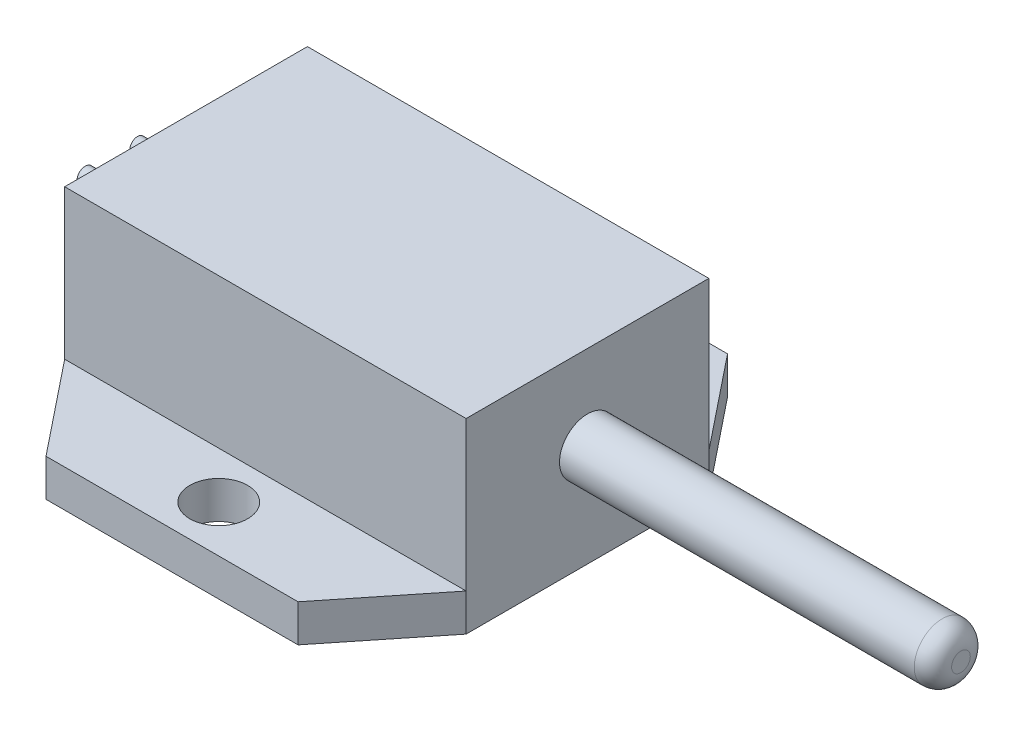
ISO-10303-21;
HEADER;
FILE_DESCRIPTION(('STEP AP214'),'2;1');
FILE_NAME('part.step','',(''),(''),'','','');
FILE_SCHEMA(('AUTOMOTIVE_DESIGN { 1 0 10303 214 1 1 1 1 }'));
ENDSEC;
DATA;
#1=APPLICATION_CONTEXT('core data for automotive mechanical design processes');
#2=APPLICATION_PROTOCOL_DEFINITION('international standard','automotive_design',2000,#1);
#3=PRODUCT_CONTEXT('',#1,'mechanical');
#4=PRODUCT('Part','Part','',(#3));
#5=PRODUCT_RELATED_PRODUCT_CATEGORY('part','',(#4));
#6=PRODUCT_DEFINITION_FORMATION('','',#4);
#7=PRODUCT_DEFINITION_CONTEXT('part definition',#1,'design');
#8=PRODUCT_DEFINITION('design','',#6,#7);
#9=PRODUCT_DEFINITION_SHAPE('','',#8);
#10=(LENGTH_UNIT() NAMED_UNIT(*) SI_UNIT(.MILLI.,.METRE.));
#11=(NAMED_UNIT(*) PLANE_ANGLE_UNIT() SI_UNIT($,.RADIAN.));
#12=(NAMED_UNIT(*) SI_UNIT($,.STERADIAN.) SOLID_ANGLE_UNIT());
#13=UNCERTAINTY_MEASURE_WITH_UNIT(LENGTH_MEASURE(1.E-05),#10,'distance_accuracy_value','');
#14=(GEOMETRIC_REPRESENTATION_CONTEXT(3) GLOBAL_UNCERTAINTY_ASSIGNED_CONTEXT((#13)) GLOBAL_UNIT_ASSIGNED_CONTEXT((#10,
#11,#12)) REPRESENTATION_CONTEXT('',''));
#15=CARTESIAN_POINT('',(0.,0.,0.));
#16=DIRECTION('',(0.,0.,1.));
#17=DIRECTION('',(1.,0.,0.));
#18=AXIS2_PLACEMENT_3D('',#15,#16,#17);
#19=CARTESIAN_POINT('',(0.,2.,0.));
#20=DIRECTION('',(0.,1.,0.));
#21=DIRECTION('',(0.,0.,1.));
#22=AXIS2_PLACEMENT_3D('',#19,#20,#21);
#23=PLANE('',#22);
#24=DIRECTION('',(-1.,0.,0.));
#25=VECTOR('',#24,1.);
#26=CARTESIAN_POINT('',(10.75,2.,-6.5));
#27=LINE('',#26,#25);
#28=CARTESIAN_POINT('',(10.75,2.,-6.5));
#29=VERTEX_POINT('',#28);
#30=CARTESIAN_POINT('',(-10.75,2.,-6.5));
#31=VERTEX_POINT('',#30);
#32=EDGE_CURVE('E356',#29,#31,#27,.T.);
#33=ORIENTED_EDGE('',*,*,#32,.F.);
#34=DIRECTION('',(0.624695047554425,0.,0.78086880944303));
#35=VECTOR('',#34,1.);
#36=CARTESIAN_POINT('',(9.72560975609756,2.,-7.78048780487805));
#37=LINE('',#36,#35);
#38=CARTESIAN_POINT('',(6.74999999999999,2.,-11.5));
#39=VERTEX_POINT('',#38);
#40=EDGE_CURVE('E391',#39,#29,#37,.T.);
#41=ORIENTED_EDGE('',*,*,#40,.F.);
#42=DIRECTION('',(1.,0.,0.));
#43=VECTOR('',#42,1.);
#44=CARTESIAN_POINT('',(-6.74999999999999,2.,-11.5));
#45=LINE('',#44,#43);
#46=CARTESIAN_POINT('',(-6.74999999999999,2.,-11.5));
#47=VERTEX_POINT('',#46);
#48=EDGE_CURVE('E236',#47,#39,#45,.T.);
#49=ORIENTED_EDGE('',*,*,#48,.F.);
#50=DIRECTION('',(0.624695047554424,0.,-0.78086880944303));
#51=VECTOR('',#50,1.);
#52=CARTESIAN_POINT('',(-9.72560975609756,2.,-7.78048780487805));
#53=LINE('',#52,#51);
#54=EDGE_CURVE('E213',#31,#47,#53,.T.);
#55=ORIENTED_EDGE('',*,*,#54,.F.);
#56=EDGE_LOOP('',(#33,#41,#49,#55));
#57=FACE_BOUND('',#56,.T.);
#58=CARTESIAN_POINT('',(0.,2.,-9.));
#59=DIRECTION('',(0.,1.,0.));
#60=DIRECTION('',(0.,0.,1.));
#61=AXIS2_PLACEMENT_3D('',#58,#59,#60);
#62=CIRCLE('',#61,1.55);
#63=CARTESIAN_POINT('',(0.,2.,-7.45));
#64=VERTEX_POINT('',#63);
#65=EDGE_CURVE('E250',#64,#64,#62,.T.);
#66=ORIENTED_EDGE('',*,*,#65,.F.);
#67=EDGE_LOOP('',(#66));
#68=FACE_BOUND('',#67,.T.);
#69=ADVANCED_FACE('F131',(#57,#68),#23,.T.);
#70=CARTESIAN_POINT('',(9.72560975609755,2.,7.78048780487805));
#71=DIRECTION('',(0.78086880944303,0.,0.624695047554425));
#72=DIRECTION('',(0.624695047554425,0.,-0.78086880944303));
#73=AXIS2_PLACEMENT_3D('',#70,#71,#72);
#74=PLANE('',#73);
#75=DIRECTION('',(-0.624695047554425,0.,0.78086880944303));
#76=VECTOR('',#75,1.);
#77=CARTESIAN_POINT('',(9.72560975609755,0.,7.78048780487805));
#78=LINE('',#77,#76);
#79=CARTESIAN_POINT('',(10.75,0.,6.5));
#80=VERTEX_POINT('',#79);
#81=CARTESIAN_POINT('',(6.75,0.,11.5));
#82=VERTEX_POINT('',#81);
#83=EDGE_CURVE('E249',#80,#82,#78,.T.);
#84=ORIENTED_EDGE('',*,*,#83,.F.);
#85=DIRECTION('',(0.,-1.,0.));
#86=VECTOR('',#85,1.);
#87=CARTESIAN_POINT('',(10.75,2.,6.5));
#88=LINE('',#87,#86);
#89=CARTESIAN_POINT('',(10.75,2.,6.5));
#90=VERTEX_POINT('',#89);
#91=EDGE_CURVE('E282',#90,#80,#88,.T.);
#92=ORIENTED_EDGE('',*,*,#91,.F.);
#93=DIRECTION('',(-0.624695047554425,0.,0.78086880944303));
#94=VECTOR('',#93,1.);
#95=CARTESIAN_POINT('',(9.72560975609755,2.,7.78048780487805));
#96=LINE('',#95,#94);
#97=CARTESIAN_POINT('',(6.75,2.,11.5));
#98=VERTEX_POINT('',#97);
#99=EDGE_CURVE('E387',#90,#98,#96,.T.);
#100=ORIENTED_EDGE('',*,*,#99,.T.);
#101=DIRECTION('',(0.,-1.,0.));
#102=VECTOR('',#101,1.);
#103=CARTESIAN_POINT('',(6.75,2.,11.5));
#104=LINE('',#103,#102);
#105=EDGE_CURVE('E156',#98,#82,#104,.T.);
#106=ORIENTED_EDGE('',*,*,#105,.T.);
#107=EDGE_LOOP('',(#84,#92,#100,#106));
#108=FACE_BOUND('',#107,.T.);
#109=ADVANCED_FACE('F461',(#108),#74,.T.);
#110=CARTESIAN_POINT('',(10.75,2.,0.));
#111=DIRECTION('',(1.,0.,0.));
#112=DIRECTION('',(0.,0.,-1.));
#113=AXIS2_PLACEMENT_3D('',#110,#111,#112);
#114=PLANE('',#113);
#115=CARTESIAN_POINT('',(10.75,5.46490983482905,0.));
#116=DIRECTION('',(1.,0.,0.));
#117=DIRECTION('',(0.,0.,-1.));
#118=AXIS2_PLACEMENT_3D('',#115,#116,#117);
#119=CIRCLE('',#118,1.5);
#120=CARTESIAN_POINT('',(10.75,5.46490983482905,-1.5));
#121=VERTEX_POINT('',#120);
#122=EDGE_CURVE('E277',#121,#121,#119,.T.);
#123=ORIENTED_EDGE('',*,*,#122,.F.);
#124=EDGE_LOOP('',(#123));
#125=FACE_BOUND('',#124,.T.);
#126=DIRECTION('',(0.,0.,1.));
#127=VECTOR('',#126,1.);
#128=CARTESIAN_POINT('',(10.75,0.,0.));
#129=LINE('',#128,#127);
#130=CARTESIAN_POINT('',(10.75,0.,-6.5));
#131=VERTEX_POINT('',#130);
#132=EDGE_CURVE('E398',#131,#80,#129,.T.);
#133=ORIENTED_EDGE('',*,*,#132,.F.);
#134=DIRECTION('',(0.,-1.,0.));
#135=VECTOR('',#134,1.);
#136=CARTESIAN_POINT('',(10.75,2.,-6.5));
#137=LINE('',#136,#135);
#138=EDGE_CURVE('E287',#29,#131,#137,.T.);
#139=ORIENTED_EDGE('',*,*,#138,.F.);
#140=DIRECTION('',(0.,-1.,0.));
#141=VECTOR('',#140,1.);
#142=CARTESIAN_POINT('',(10.75,10.,-6.5));
#143=LINE('',#142,#141);
#144=CARTESIAN_POINT('',(10.75,10.,-6.5));
#145=VERTEX_POINT('',#144);
#146=EDGE_CURVE('E377',#145,#29,#143,.T.);
#147=ORIENTED_EDGE('',*,*,#146,.F.);
#148=DIRECTION('',(0.,0.,-1.));
#149=VECTOR('',#148,1.);
#150=CARTESIAN_POINT('',(10.75,10.,6.5));
#151=LINE('',#150,#149);
#152=CARTESIAN_POINT('',(10.75,10.,6.5));
#153=VERTEX_POINT('',#152);
#154=EDGE_CURVE('E360',#153,#145,#151,.T.);
#155=ORIENTED_EDGE('',*,*,#154,.F.);
#156=DIRECTION('',(0.,-1.,0.));
#157=VECTOR('',#156,1.);
#158=CARTESIAN_POINT('',(10.75,10.,6.5));
#159=LINE('',#158,#157);
#160=EDGE_CURVE('E381',#153,#90,#159,.T.);
#161=ORIENTED_EDGE('',*,*,#160,.T.);
#162=ORIENTED_EDGE('',*,*,#91,.T.);
#163=EDGE_LOOP('',(#133,#139,#147,#155,#161,#162));
#164=FACE_BOUND('',#163,.T.);
#165=ADVANCED_FACE('F452',(#125,#164),#114,.T.);
#166=CARTESIAN_POINT('',(9.72560975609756,2.,-7.78048780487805));
#167=DIRECTION('',(0.78086880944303,0.,-0.624695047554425));
#168=DIRECTION('',(-0.624695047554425,0.,-0.78086880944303));
#169=AXIS2_PLACEMENT_3D('',#166,#167,#168);
#170=PLANE('',#169);
#171=DIRECTION('',(0.624695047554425,0.,0.78086880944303));
#172=VECTOR('',#171,1.);
#173=CARTESIAN_POINT('',(9.72560975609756,0.,-7.78048780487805));
#174=LINE('',#173,#172);
#175=CARTESIAN_POINT('',(6.74999999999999,0.,-11.5));
#176=VERTEX_POINT('',#175);
#177=EDGE_CURVE('E392',#176,#131,#174,.T.);
#178=ORIENTED_EDGE('',*,*,#177,.F.);
#179=DIRECTION('',(0.,-1.,0.));
#180=VECTOR('',#179,1.);
#181=CARTESIAN_POINT('',(6.74999999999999,2.,-11.5));
#182=LINE('',#181,#180);
#183=EDGE_CURVE('E407',#39,#176,#182,.T.);
#184=ORIENTED_EDGE('',*,*,#183,.F.);
#185=ORIENTED_EDGE('',*,*,#40,.T.);
#186=ORIENTED_EDGE('',*,*,#138,.T.);
#187=EDGE_LOOP('',(#178,#184,#185,#186));
#188=FACE_BOUND('',#187,.T.);
#189=ADVANCED_FACE('F455',(#188),#170,.T.);
#190=DIRECTION('',(1.,0.,0.));
#191=VECTOR('',#190,1.);
#192=CARTESIAN_POINT('',(10.75,2.,6.5));
#193=LINE('',#192,#191);
#194=CARTESIAN_POINT('',(-10.75,2.,6.5));
#195=VERTEX_POINT('',#194);
#196=EDGE_CURVE('E340',#195,#90,#193,.T.);
#197=ORIENTED_EDGE('',*,*,#196,.F.);
#198=DIRECTION('',(-0.624695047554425,0.,-0.78086880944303));
#199=VECTOR('',#198,1.);
#200=CARTESIAN_POINT('',(-9.72560975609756,2.,7.78048780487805));
#201=LINE('',#200,#199);
#202=CARTESIAN_POINT('',(-6.75,2.,11.5));
#203=VERTEX_POINT('',#202);
#204=EDGE_CURVE('E207',#203,#195,#201,.T.);
#205=ORIENTED_EDGE('',*,*,#204,.F.);
#206=DIRECTION('',(1.,0.,0.));
#207=VECTOR('',#206,1.);
#208=CARTESIAN_POINT('',(-6.75,2.,11.5));
#209=LINE('',#208,#207);
#210=EDGE_CURVE('E231',#203,#98,#209,.T.);
#211=ORIENTED_EDGE('',*,*,#210,.T.);
#212=ORIENTED_EDGE('',*,*,#99,.F.);
#213=EDGE_LOOP('',(#197,#205,#211,#212));
#214=FACE_BOUND('',#213,.T.);
#215=CARTESIAN_POINT('',(0.,2.,9.));
#216=DIRECTION('',(0.,1.,0.));
#217=DIRECTION('',(0.,0.,1.));
#218=AXIS2_PLACEMENT_3D('',#215,#216,#217);
#219=CIRCLE('',#218,1.55);
#220=CARTESIAN_POINT('',(0.,2.,10.55));
#221=VERTEX_POINT('',#220);
#222=EDGE_CURVE('E260',#221,#221,#219,.T.);
#223=ORIENTED_EDGE('',*,*,#222,.F.);
#224=EDGE_LOOP('',(#223));
#225=FACE_BOUND('',#224,.T.);
#226=ADVANCED_FACE('F464',(#214,#225),#23,.T.);
#227=CARTESIAN_POINT('',(0.,0.,0.));
#228=DIRECTION('',(0.,1.,0.));
#229=DIRECTION('',(0.,0.,1.));
#230=AXIS2_PLACEMENT_3D('',#227,#228,#229);
#231=PLANE('',#230);
#232=ORIENTED_EDGE('',*,*,#83,.T.);
#233=DIRECTION('',(1.,0.,0.));
#234=VECTOR('',#233,1.);
#235=CARTESIAN_POINT('',(-6.75,0.,11.5));
#236=LINE('',#235,#234);
#237=CARTESIAN_POINT('',(-6.75,0.,11.5));
#238=VERTEX_POINT('',#237);
#239=EDGE_CURVE('E229',#238,#82,#236,.T.);
#240=ORIENTED_EDGE('',*,*,#239,.F.);
#241=DIRECTION('',(-0.624695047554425,0.,-0.78086880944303));
#242=VECTOR('',#241,1.);
#243=CARTESIAN_POINT('',(-9.72560975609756,0.,7.78048780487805));
#244=LINE('',#243,#242);
#245=CARTESIAN_POINT('',(-10.75,0.,6.5));
#246=VERTEX_POINT('',#245);
#247=EDGE_CURVE('E205',#238,#246,#244,.T.);
#248=ORIENTED_EDGE('',*,*,#247,.T.);
#249=DIRECTION('',(0.,0.,1.));
#250=VECTOR('',#249,1.);
#251=CARTESIAN_POINT('',(-10.75,0.,0.));
#252=LINE('',#251,#250);
#253=CARTESIAN_POINT('',(-10.75,0.,-6.5));
#254=VERTEX_POINT('',#253);
#255=EDGE_CURVE('E216',#254,#246,#252,.T.);
#256=ORIENTED_EDGE('',*,*,#255,.F.);
#257=DIRECTION('',(0.624695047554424,0.,-0.78086880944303));
#258=VECTOR('',#257,1.);
#259=CARTESIAN_POINT('',(-9.72560975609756,0.,-7.78048780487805));
#260=LINE('',#259,#258);
#261=CARTESIAN_POINT('',(-6.74999999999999,0.,-11.5));
#262=VERTEX_POINT('',#261);
#263=EDGE_CURVE('E223',#254,#262,#260,.T.);
#264=ORIENTED_EDGE('',*,*,#263,.T.);
#265=DIRECTION('',(1.,0.,0.));
#266=VECTOR('',#265,1.);
#267=CARTESIAN_POINT('',(-6.74999999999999,0.,-11.5));
#268=LINE('',#267,#266);
#269=EDGE_CURVE('E264',#262,#176,#268,.T.);
#270=ORIENTED_EDGE('',*,*,#269,.T.);
#271=ORIENTED_EDGE('',*,*,#177,.T.);
#272=ORIENTED_EDGE('',*,*,#132,.T.);
#273=EDGE_LOOP('',(#232,#240,#248,#256,#264,#270,#271,#272));
#274=FACE_BOUND('',#273,.T.);
#275=CARTESIAN_POINT('',(0.,0.,9.));
#276=DIRECTION('',(0.,1.,0.));
#277=DIRECTION('',(0.,0.,1.));
#278=AXIS2_PLACEMENT_3D('',#275,#276,#277);
#279=CIRCLE('',#278,1.55);
#280=CARTESIAN_POINT('',(0.,0.,10.55));
#281=VERTEX_POINT('',#280);
#282=EDGE_CURVE('E254',#281,#281,#279,.T.);
#283=ORIENTED_EDGE('',*,*,#282,.T.);
#284=EDGE_LOOP('',(#283));
#285=FACE_BOUND('',#284,.T.);
#286=CARTESIAN_POINT('',(0.,0.,-9.));
#287=DIRECTION('',(0.,1.,0.));
#288=DIRECTION('',(0.,0.,1.));
#289=AXIS2_PLACEMENT_3D('',#286,#287,#288);
#290=CIRCLE('',#289,1.55);
#291=CARTESIAN_POINT('',(0.,0.,-7.45));
#292=VERTEX_POINT('',#291);
#293=EDGE_CURVE('E255',#292,#292,#290,.T.);
#294=ORIENTED_EDGE('',*,*,#293,.T.);
#295=EDGE_LOOP('',(#294));
#296=FACE_BOUND('',#295,.T.);
#297=ADVANCED_FACE('F227',(#274,#285,#296),#231,.F.);
#298=CARTESIAN_POINT('',(-10.75,2.,0.));
#299=DIRECTION('',(1.,0.,0.));
#300=DIRECTION('',(0.,0.,-1.));
#301=AXIS2_PLACEMENT_3D('',#298,#299,#300);
#302=PLANE('',#301);
#303=DIRECTION('',(0.,0.,1.));
#304=VECTOR('',#303,1.);
#305=CARTESIAN_POINT('',(-10.75,4.95873916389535,-1.5));
#306=LINE('',#305,#304);
#307=CARTESIAN_POINT('',(-10.75,4.95873916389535,-1.5));
#308=VERTEX_POINT('',#307);
#309=CARTESIAN_POINT('',(-10.75,4.95873916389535,1.5));
#310=VERTEX_POINT('',#309);
#311=EDGE_CURVE('E326',#308,#310,#306,.T.);
#312=ORIENTED_EDGE('',*,*,#311,.F.);
#313=CARTESIAN_POINT('',(-10.75,5.95873916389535,-1.5));
#314=DIRECTION('',(-1.,0.,0.));
#315=DIRECTION('',(0.,0.,1.));
#316=AXIS2_PLACEMENT_3D('',#313,#314,#315);
#317=CIRCLE('',#316,1.);
#318=CARTESIAN_POINT('',(-10.75,6.95873916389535,-1.5));
#319=VERTEX_POINT('',#318);
#320=EDGE_CURVE('E147',#319,#308,#317,.T.);
#321=ORIENTED_EDGE('',*,*,#320,.F.);
#322=DIRECTION('',(0.,0.,-1.));
#323=VECTOR('',#322,1.);
#324=CARTESIAN_POINT('',(-10.75,6.95873916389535,-1.5));
#325=LINE('',#324,#323);
#326=CARTESIAN_POINT('',(-10.75,6.95873916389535,1.5));
#327=VERTEX_POINT('',#326);
#328=EDGE_CURVE('E311',#327,#319,#325,.T.);
#329=ORIENTED_EDGE('',*,*,#328,.F.);
#330=CARTESIAN_POINT('',(-10.75,5.95873916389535,1.5));
#331=DIRECTION('',(-1.,0.,0.));
#332=DIRECTION('',(0.,0.,1.));
#333=AXIS2_PLACEMENT_3D('',#330,#331,#332);
#334=CIRCLE('',#333,1.);
#335=EDGE_CURVE('E330',#310,#327,#334,.T.);
#336=ORIENTED_EDGE('',*,*,#335,.F.);
#337=EDGE_LOOP('',(#312,#321,#329,#336));
#338=FACE_BOUND('',#337,.T.);
#339=ORIENTED_EDGE('',*,*,#255,.T.);
#340=DIRECTION('',(0.,-1.,0.));
#341=VECTOR('',#340,1.);
#342=CARTESIAN_POINT('',(-10.75,2.,6.5));
#343=LINE('',#342,#341);
#344=EDGE_CURVE('E201',#195,#246,#343,.T.);
#345=ORIENTED_EDGE('',*,*,#344,.F.);
#346=DIRECTION('',(0.,-1.,0.));
#347=VECTOR('',#346,1.);
#348=CARTESIAN_POINT('',(-10.75,10.,6.5));
#349=LINE('',#348,#347);
#350=CARTESIAN_POINT('',(-10.75,10.,6.5));
#351=VERTEX_POINT('',#350);
#352=EDGE_CURVE('E259',#351,#195,#349,.T.);
#353=ORIENTED_EDGE('',*,*,#352,.F.);
#354=DIRECTION('',(0.,0.,1.));
#355=VECTOR('',#354,1.);
#356=CARTESIAN_POINT('',(-10.75,10.,6.5));
#357=LINE('',#356,#355);
#358=CARTESIAN_POINT('',(-10.75,10.,-6.5));
#359=VERTEX_POINT('',#358);
#360=EDGE_CURVE('E351',#359,#351,#357,.T.);
#361=ORIENTED_EDGE('',*,*,#360,.F.);
#362=DIRECTION('',(0.,-1.,0.));
#363=VECTOR('',#362,1.);
#364=CARTESIAN_POINT('',(-10.75,10.,-6.5));
#365=LINE('',#364,#363);
#366=EDGE_CURVE('E368',#359,#31,#365,.T.);
#367=ORIENTED_EDGE('',*,*,#366,.T.);
#368=DIRECTION('',(0.,-1.,0.));
#369=VECTOR('',#368,1.);
#370=CARTESIAN_POINT('',(-10.75,2.,-6.5));
#371=LINE('',#370,#369);
#372=EDGE_CURVE('E212',#31,#254,#371,.T.);
#373=ORIENTED_EDGE('',*,*,#372,.T.);
#374=EDGE_LOOP('',(#339,#345,#353,#361,#367,#373));
#375=FACE_BOUND('',#374,.T.);
#376=ADVANCED_FACE('F217',(#338,#375),#302,.F.);
#377=CARTESIAN_POINT('',(-9.72560975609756,2.,7.78048780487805));
#378=DIRECTION('',(-0.78086880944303,0.,0.624695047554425));
#379=DIRECTION('',(0.624695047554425,0.,0.78086880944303));
#380=AXIS2_PLACEMENT_3D('',#377,#378,#379);
#381=PLANE('',#380);
#382=ORIENTED_EDGE('',*,*,#247,.F.);
#383=DIRECTION('',(0.,-1.,0.));
#384=VECTOR('',#383,1.);
#385=CARTESIAN_POINT('',(-6.75,2.,11.5));
#386=LINE('',#385,#384);
#387=EDGE_CURVE('E246',#203,#238,#386,.T.);
#388=ORIENTED_EDGE('',*,*,#387,.F.);
#389=ORIENTED_EDGE('',*,*,#204,.T.);
#390=ORIENTED_EDGE('',*,*,#344,.T.);
#391=EDGE_LOOP('',(#382,#388,#389,#390));
#392=FACE_BOUND('',#391,.T.);
#393=ADVANCED_FACE('F203',(#392),#381,.T.);
#394=CARTESIAN_POINT('',(0.,2.,-9.));
#395=DIRECTION('',(0.,-1.,0.));
#396=DIRECTION('',(0.,0.,-1.));
#397=AXIS2_PLACEMENT_3D('',#394,#395,#396);
#398=CYLINDRICAL_SURFACE('',#397,1.55);
#399=ORIENTED_EDGE('',*,*,#65,.T.);
#400=EDGE_LOOP('',(#399));
#401=FACE_BOUND('',#400,.T.);
#402=ORIENTED_EDGE('',*,*,#293,.F.);
#403=EDGE_LOOP('',(#402));
#404=FACE_BOUND('',#403,.T.);
#405=ADVANCED_FACE('F502',(#401,#404),#398,.F.);
#406=CARTESIAN_POINT('',(-6.75,2.,11.5));
#407=DIRECTION('',(0.,0.,-1.));
#408=DIRECTION('',(-1.,0.,0.));
#409=AXIS2_PLACEMENT_3D('',#406,#407,#408);
#410=PLANE('',#409);
#411=ORIENTED_EDGE('',*,*,#239,.T.);
#412=ORIENTED_EDGE('',*,*,#105,.F.);
#413=ORIENTED_EDGE('',*,*,#210,.F.);
#414=ORIENTED_EDGE('',*,*,#387,.T.);
#415=EDGE_LOOP('',(#411,#412,#413,#414));
#416=FACE_BOUND('',#415,.T.);
#417=ADVANCED_FACE('F462',(#416),#410,.F.);
#418=CARTESIAN_POINT('',(0.,2.,9.));
#419=DIRECTION('',(0.,-1.,0.));
#420=DIRECTION('',(0.,0.,-1.));
#421=AXIS2_PLACEMENT_3D('',#418,#419,#420);
#422=CYLINDRICAL_SURFACE('',#421,1.55);
#423=ORIENTED_EDGE('',*,*,#222,.T.);
#424=EDGE_LOOP('',(#423));
#425=FACE_BOUND('',#424,.T.);
#426=ORIENTED_EDGE('',*,*,#282,.F.);
#427=EDGE_LOOP('',(#426));
#428=FACE_BOUND('',#427,.T.);
#429=ADVANCED_FACE('F499',(#425,#428),#422,.F.);
#430=CARTESIAN_POINT('',(-9.72560975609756,2.,-7.78048780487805));
#431=DIRECTION('',(-0.78086880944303,0.,-0.624695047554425));
#432=DIRECTION('',(-0.624695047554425,0.,0.78086880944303));
#433=AXIS2_PLACEMENT_3D('',#430,#431,#432);
#434=PLANE('',#433);
#435=ORIENTED_EDGE('',*,*,#263,.F.);
#436=ORIENTED_EDGE('',*,*,#372,.F.);
#437=ORIENTED_EDGE('',*,*,#54,.T.);
#438=DIRECTION('',(0.,-1.,0.));
#439=VECTOR('',#438,1.);
#440=CARTESIAN_POINT('',(-6.74999999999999,2.,-11.5));
#441=LINE('',#440,#439);
#442=EDGE_CURVE('E243',#47,#262,#441,.T.);
#443=ORIENTED_EDGE('',*,*,#442,.T.);
#444=EDGE_LOOP('',(#435,#436,#437,#443));
#445=FACE_BOUND('',#444,.T.);
#446=ADVANCED_FACE('F416',(#445),#434,.T.);
#447=CARTESIAN_POINT('',(-6.74999999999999,2.,-11.5));
#448=DIRECTION('',(0.,0.,-1.));
#449=DIRECTION('',(-1.,0.,0.));
#450=AXIS2_PLACEMENT_3D('',#447,#448,#449);
#451=PLANE('',#450);
#452=ORIENTED_EDGE('',*,*,#269,.F.);
#453=ORIENTED_EDGE('',*,*,#442,.F.);
#454=ORIENTED_EDGE('',*,*,#48,.T.);
#455=ORIENTED_EDGE('',*,*,#183,.T.);
#456=EDGE_LOOP('',(#452,#453,#454,#455));
#457=FACE_BOUND('',#456,.T.);
#458=ADVANCED_FACE('F457',(#457),#451,.T.);
#459=CARTESIAN_POINT('',(10.75,10.,6.5));
#460=DIRECTION('',(0.,0.,-1.));
#461=DIRECTION('',(-1.,0.,0.));
#462=AXIS2_PLACEMENT_3D('',#459,#460,#461);
#463=PLANE('',#462);
#464=ORIENTED_EDGE('',*,*,#196,.T.);
#465=ORIENTED_EDGE('',*,*,#160,.F.);
#466=DIRECTION('',(1.,0.,0.));
#467=VECTOR('',#466,1.);
#468=CARTESIAN_POINT('',(10.75,10.,6.5));
#469=LINE('',#468,#467);
#470=EDGE_CURVE('E355',#351,#153,#469,.T.);
#471=ORIENTED_EDGE('',*,*,#470,.F.);
#472=ORIENTED_EDGE('',*,*,#352,.T.);
#473=EDGE_LOOP('',(#464,#465,#471,#472));
#474=FACE_BOUND('',#473,.T.);
#475=ADVANCED_FACE('F466',(#474),#463,.F.);
#476=CARTESIAN_POINT('',(10.75,10.,-6.5));
#477=DIRECTION('',(0.,0.,1.));
#478=DIRECTION('',(1.,0.,0.));
#479=AXIS2_PLACEMENT_3D('',#476,#477,#478);
#480=PLANE('',#479);
#481=ORIENTED_EDGE('',*,*,#32,.T.);
#482=ORIENTED_EDGE('',*,*,#366,.F.);
#483=DIRECTION('',(-1.,0.,0.));
#484=VECTOR('',#483,1.);
#485=CARTESIAN_POINT('',(10.75,10.,-6.5));
#486=LINE('',#485,#484);
#487=EDGE_CURVE('E364',#145,#359,#486,.T.);
#488=ORIENTED_EDGE('',*,*,#487,.F.);
#489=ORIENTED_EDGE('',*,*,#146,.T.);
#490=EDGE_LOOP('',(#481,#482,#488,#489));
#491=FACE_BOUND('',#490,.T.);
#492=ADVANCED_FACE('F426',(#491),#480,.F.);
#493=CARTESIAN_POINT('',(0.,10.,0.));
#494=DIRECTION('',(0.,1.,0.));
#495=DIRECTION('',(0.,0.,1.));
#496=AXIS2_PLACEMENT_3D('',#493,#494,#495);
#497=PLANE('',#496);
#498=ORIENTED_EDGE('',*,*,#360,.T.);
#499=ORIENTED_EDGE('',*,*,#470,.T.);
#500=ORIENTED_EDGE('',*,*,#154,.T.);
#501=ORIENTED_EDGE('',*,*,#487,.T.);
#502=EDGE_LOOP('',(#498,#499,#500,#501));
#503=FACE_BOUND('',#502,.T.);
#504=ADVANCED_FACE('F434',(#503),#497,.T.);
#505=CARTESIAN_POINT('',(-9.75,5.95873916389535,-1.5));
#506=DIRECTION('',(-1.,0.,0.));
#507=DIRECTION('',(0.,0.,1.));
#508=AXIS2_PLACEMENT_3D('',#505,#506,#507);
#509=CYLINDRICAL_SURFACE('',#508,1.);
#510=ORIENTED_EDGE('',*,*,#320,.T.);
#511=DIRECTION('',(-1.,0.,0.));
#512=VECTOR('',#511,1.);
#513=CARTESIAN_POINT('',(-9.75,4.95873916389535,-1.5));
#514=LINE('',#513,#512);
#515=CARTESIAN_POINT('',(-9.75,4.95873916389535,-1.5));
#516=VERTEX_POINT('',#515);
#517=EDGE_CURVE('E323',#516,#308,#514,.T.);
#518=ORIENTED_EDGE('',*,*,#517,.F.);
#519=CARTESIAN_POINT('',(-9.75,5.95873916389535,-1.5));
#520=DIRECTION('',(-1.,0.,0.));
#521=DIRECTION('',(0.,0.,1.));
#522=AXIS2_PLACEMENT_3D('',#519,#520,#521);
#523=CIRCLE('',#522,1.);
#524=CARTESIAN_POINT('',(-9.75,6.95873916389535,-1.5));
#525=VERTEX_POINT('',#524);
#526=EDGE_CURVE('E306',#525,#516,#523,.T.);
#527=ORIENTED_EDGE('',*,*,#526,.F.);
#528=DIRECTION('',(-1.,0.,0.));
#529=VECTOR('',#528,1.);
#530=CARTESIAN_POINT('',(-9.75,6.95873916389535,-1.5));
#531=LINE('',#530,#529);
#532=EDGE_CURVE('E337',#525,#319,#531,.T.);
#533=ORIENTED_EDGE('',*,*,#532,.T.);
#534=EDGE_LOOP('',(#510,#518,#527,#533));
#535=FACE_BOUND('',#534,.T.);
#536=ADVANCED_FACE('F545',(#535),#509,.F.);
#537=CARTESIAN_POINT('',(-9.75,6.95873916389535,-1.5));
#538=DIRECTION('',(0.,1.,0.));
#539=DIRECTION('',(0.,0.,1.));
#540=AXIS2_PLACEMENT_3D('',#537,#538,#539);
#541=PLANE('',#540);
#542=ORIENTED_EDGE('',*,*,#328,.T.);
#543=ORIENTED_EDGE('',*,*,#532,.F.);
#544=DIRECTION('',(0.,0.,-1.));
#545=VECTOR('',#544,1.);
#546=CARTESIAN_POINT('',(-9.75,6.95873916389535,-1.5));
#547=LINE('',#546,#545);
#548=CARTESIAN_POINT('',(-9.75,6.95873916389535,1.5));
#549=VERTEX_POINT('',#548);
#550=EDGE_CURVE('E319',#549,#525,#547,.T.);
#551=ORIENTED_EDGE('',*,*,#550,.F.);
#552=DIRECTION('',(-1.,0.,0.));
#553=VECTOR('',#552,1.);
#554=CARTESIAN_POINT('',(-9.75,6.95873916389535,1.5));
#555=LINE('',#554,#553);
#556=EDGE_CURVE('E341',#549,#327,#555,.T.);
#557=ORIENTED_EDGE('',*,*,#556,.T.);
#558=EDGE_LOOP('',(#542,#543,#551,#557));
#559=FACE_BOUND('',#558,.T.);
#560=ADVANCED_FACE('F554',(#559),#541,.F.);
#561=CARTESIAN_POINT('',(-9.75,5.95873916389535,1.5));
#562=DIRECTION('',(-1.,0.,0.));
#563=DIRECTION('',(0.,0.,1.));
#564=AXIS2_PLACEMENT_3D('',#561,#562,#563);
#565=CYLINDRICAL_SURFACE('',#564,1.);
#566=ORIENTED_EDGE('',*,*,#335,.T.);
#567=ORIENTED_EDGE('',*,*,#556,.F.);
#568=CARTESIAN_POINT('',(-9.75,5.95873916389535,1.5));
#569=DIRECTION('',(-1.,0.,0.));
#570=DIRECTION('',(0.,0.,1.));
#571=AXIS2_PLACEMENT_3D('',#568,#569,#570);
#572=CIRCLE('',#571,1.);
#573=CARTESIAN_POINT('',(-9.75,4.95873916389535,1.5));
#574=VERTEX_POINT('',#573);
#575=EDGE_CURVE('E315',#574,#549,#572,.T.);
#576=ORIENTED_EDGE('',*,*,#575,.F.);
#577=DIRECTION('',(-1.,0.,0.));
#578=VECTOR('',#577,1.);
#579=CARTESIAN_POINT('',(-9.75,4.95873916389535,1.5));
#580=LINE('',#579,#578);
#581=EDGE_CURVE('E345',#574,#310,#580,.T.);
#582=ORIENTED_EDGE('',*,*,#581,.T.);
#583=EDGE_LOOP('',(#566,#567,#576,#582));
#584=FACE_BOUND('',#583,.T.);
#585=ADVANCED_FACE('F563',(#584),#565,.F.);
#586=CARTESIAN_POINT('',(-9.75,4.95873916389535,-1.5));
#587=DIRECTION('',(0.,-1.,0.));
#588=DIRECTION('',(0.,0.,-1.));
#589=AXIS2_PLACEMENT_3D('',#586,#587,#588);
#590=PLANE('',#589);
#591=ORIENTED_EDGE('',*,*,#311,.T.);
#592=ORIENTED_EDGE('',*,*,#581,.F.);
#593=DIRECTION('',(0.,0.,1.));
#594=VECTOR('',#593,1.);
#595=CARTESIAN_POINT('',(-9.75,4.95873916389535,-1.5));
#596=LINE('',#595,#594);
#597=EDGE_CURVE('E310',#516,#574,#596,.T.);
#598=ORIENTED_EDGE('',*,*,#597,.F.);
#599=ORIENTED_EDGE('',*,*,#517,.T.);
#600=EDGE_LOOP('',(#591,#592,#598,#599));
#601=FACE_BOUND('',#600,.T.);
#602=ADVANCED_FACE('F573',(#601),#590,.F.);
#603=CARTESIAN_POINT('',(-9.75,5.95873916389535,-1.5));
#604=DIRECTION('',(-1.,0.,0.));
#605=DIRECTION('',(0.,0.,1.));
#606=AXIS2_PLACEMENT_3D('',#603,#604,#605);
#607=PLANE('',#606);
#608=CARTESIAN_POINT('',(-9.75,5.96733153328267,-1.4));
#609=DIRECTION('',(-1.,0.,0.));
#610=DIRECTION('',(0.,0.,1.));
#611=AXIS2_PLACEMENT_3D('',#608,#609,#610);
#612=CIRCLE('',#611,0.413581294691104);
#613=CARTESIAN_POINT('',(-9.75,5.96733153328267,-0.986418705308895));
#614=VERTEX_POINT('',#613);
#615=EDGE_CURVE('E294',#614,#614,#612,.T.);
#616=ORIENTED_EDGE('',*,*,#615,.F.);
#617=EDGE_LOOP('',(#616));
#618=FACE_BOUND('',#617,.T.);
#619=CARTESIAN_POINT('',(-9.75,5.96733153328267,1.4));
#620=DIRECTION('',(-1.,0.,0.));
#621=DIRECTION('',(0.,0.,1.));
#622=AXIS2_PLACEMENT_3D('',#619,#620,#621);
#623=CIRCLE('',#622,0.43765739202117);
#624=CARTESIAN_POINT('',(-9.75,5.96733153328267,1.83765739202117));
#625=VERTEX_POINT('',#624);
#626=EDGE_CURVE('E298',#625,#625,#623,.T.);
#627=ORIENTED_EDGE('',*,*,#626,.F.);
#628=EDGE_LOOP('',(#627));
#629=FACE_BOUND('',#628,.T.);
#630=ORIENTED_EDGE('',*,*,#526,.T.);
#631=ORIENTED_EDGE('',*,*,#597,.T.);
#632=ORIENTED_EDGE('',*,*,#575,.T.);
#633=ORIENTED_EDGE('',*,*,#550,.T.);
#634=EDGE_LOOP('',(#630,#631,#632,#633));
#635=FACE_BOUND('',#634,.T.);
#636=ADVANCED_FACE('F583',(#618,#629,#635),#607,.T.);
#637=CARTESIAN_POINT('',(-14.75,5.96733153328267,1.4));
#638=DIRECTION('',(1.,0.,0.));
#639=DIRECTION('',(0.,0.,-1.));
#640=AXIS2_PLACEMENT_3D('',#637,#638,#639);
#641=CYLINDRICAL_SURFACE('',#640,0.43765739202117);
#642=CARTESIAN_POINT('',(-14.75,5.96733153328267,1.4));
#643=DIRECTION('',(-1.,0.,0.));
#644=DIRECTION('',(0.,0.,1.));
#645=AXIS2_PLACEMENT_3D('',#642,#643,#644);
#646=CIRCLE('',#645,0.43765739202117);
#647=CARTESIAN_POINT('',(-14.75,5.96733153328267,1.83765739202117));
#648=VERTEX_POINT('',#647);
#649=EDGE_CURVE('E302',#648,#648,#646,.T.);
#650=ORIENTED_EDGE('',*,*,#649,.F.);
#651=EDGE_LOOP('',(#650));
#652=FACE_BOUND('',#651,.T.);
#653=ORIENTED_EDGE('',*,*,#626,.T.);
#654=EDGE_LOOP('',(#653));
#655=FACE_BOUND('',#654,.T.);
#656=ADVANCED_FACE('F593',(#652,#655),#641,.T.);
#657=CARTESIAN_POINT('',(-14.75,5.96733153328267,1.4));
#658=DIRECTION('',(-1.,0.,0.));
#659=DIRECTION('',(0.,0.,1.));
#660=AXIS2_PLACEMENT_3D('',#657,#658,#659);
#661=PLANE('',#660);
#662=ORIENTED_EDGE('',*,*,#649,.T.);
#663=EDGE_LOOP('',(#662));
#664=FACE_BOUND('',#663,.T.);
#665=ADVANCED_FACE('F603',(#664),#661,.T.);
#666=CARTESIAN_POINT('',(-14.75,5.96733153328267,-1.4));
#667=DIRECTION('',(1.,0.,0.));
#668=DIRECTION('',(0.,0.,-1.));
#669=AXIS2_PLACEMENT_3D('',#666,#667,#668);
#670=CYLINDRICAL_SURFACE('',#669,0.413581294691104);
#671=CARTESIAN_POINT('',(-14.75,5.96733153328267,-1.4));
#672=DIRECTION('',(-1.,0.,0.));
#673=DIRECTION('',(0.,0.,1.));
#674=AXIS2_PLACEMENT_3D('',#671,#672,#673);
#675=CIRCLE('',#674,0.413581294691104);
#676=CARTESIAN_POINT('',(-14.75,5.96733153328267,-0.986418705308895));
#677=VERTEX_POINT('',#676);
#678=EDGE_CURVE('E290',#677,#677,#675,.T.);
#679=ORIENTED_EDGE('',*,*,#678,.F.);
#680=EDGE_LOOP('',(#679));
#681=FACE_BOUND('',#680,.T.);
#682=ORIENTED_EDGE('',*,*,#615,.T.);
#683=EDGE_LOOP('',(#682));
#684=FACE_BOUND('',#683,.T.);
#685=ADVANCED_FACE('F613',(#681,#684),#670,.T.);
#686=CARTESIAN_POINT('',(-14.75,5.96733153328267,-1.4));
#687=DIRECTION('',(-1.,0.,0.));
#688=DIRECTION('',(0.,0.,1.));
#689=AXIS2_PLACEMENT_3D('',#686,#687,#688);
#690=PLANE('',#689);
#691=ORIENTED_EDGE('',*,*,#678,.T.);
#692=EDGE_LOOP('',(#691));
#693=FACE_BOUND('',#692,.T.);
#694=ADVANCED_FACE('F623',(#693),#690,.T.);
#695=CARTESIAN_POINT('',(30.75,5.46490983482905,0.));
#696=DIRECTION('',(-1.,0.,0.));
#697=DIRECTION('',(0.,0.,1.));
#698=AXIS2_PLACEMENT_3D('',#695,#696,#697);
#699=CYLINDRICAL_SURFACE('',#698,1.5);
#700=CARTESIAN_POINT('',(29.75,5.46490983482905,0.));
#701=DIRECTION('',(1.,0.,0.));
#702=DIRECTION('',(0.,0.,-1.));
#703=AXIS2_PLACEMENT_3D('',#700,#701,#702);
#704=CIRCLE('',#703,1.5);
#705=CARTESIAN_POINT('',(29.75,5.46490983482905,-1.5));
#706=VERTEX_POINT('',#705);
#707=EDGE_CURVE('E12',#706,#706,#704,.F.);
#708=ORIENTED_EDGE('',*,*,#707,.T.);
#709=EDGE_LOOP('',(#708));
#710=FACE_BOUND('',#709,.T.);
#711=ORIENTED_EDGE('',*,*,#122,.T.);
#712=EDGE_LOOP('',(#711));
#713=FACE_BOUND('',#712,.T.);
#714=ADVANCED_FACE('F633',(#710,#713),#699,.T.);
#715=CARTESIAN_POINT('',(30.75,5.46490983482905,0.));
#716=DIRECTION('',(1.,0.,0.));
#717=DIRECTION('',(0.,0.,-1.));
#718=AXIS2_PLACEMENT_3D('',#715,#716,#717);
#719=PLANE('',#718);
#720=CARTESIAN_POINT('',(30.75,5.46490983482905,0.));
#721=DIRECTION('',(1.,0.,0.));
#722=DIRECTION('',(0.,0.,-1.));
#723=AXIS2_PLACEMENT_3D('',#720,#721,#722);
#724=CIRCLE('',#723,0.5);
#725=CARTESIAN_POINT('',(30.75,5.46490983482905,-0.5));
#726=VERTEX_POINT('',#725);
#727=EDGE_CURVE('E140',#726,#726,#724,.T.);
#728=ORIENTED_EDGE('',*,*,#727,.T.);
#729=EDGE_LOOP('',(#728));
#730=FACE_BOUND('',#729,.T.);
#731=ADVANCED_FACE('F643',(#730),#719,.T.);
#732=CARTESIAN_POINT('',(29.75,5.46490983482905,0.));
#733=DIRECTION('',(1.,0.,0.));
#734=DIRECTION('',(0.,0.,-1.));
#735=AXIS2_PLACEMENT_3D('',#732,#733,#734);
#736=DEGENERATE_TOROIDAL_SURFACE('',#735,0.5,1.,.T.);
#737=ORIENTED_EDGE('',*,*,#707,.F.);
#738=EDGE_LOOP('',(#737));
#739=FACE_BOUND('',#738,.T.);
#740=ORIENTED_EDGE('',*,*,#727,.F.);
#741=EDGE_LOOP('',(#740));
#742=FACE_BOUND('',#741,.T.);
#743=ADVANCED_FACE('F133',(#739,#742),#736,.T.);
#744=CLOSED_SHELL('',(#69,#109,#165,#189,#226,#297,#376,#393,#405,#417,#429,#446,#458,#475,#492,
#504,#536,#560,#585,#602,#636,#656,#665,#685,#694,#714,#731,#743));
#745=MANIFOLD_SOLID_BREP('B2',#744);
#746=ADVANCED_BREP_SHAPE_REPRESENTATION('',(#18,#745),#14);
#747=SHAPE_DEFINITION_REPRESENTATION(#9,#746);
ENDSEC;
END-ISO-10303-21;
